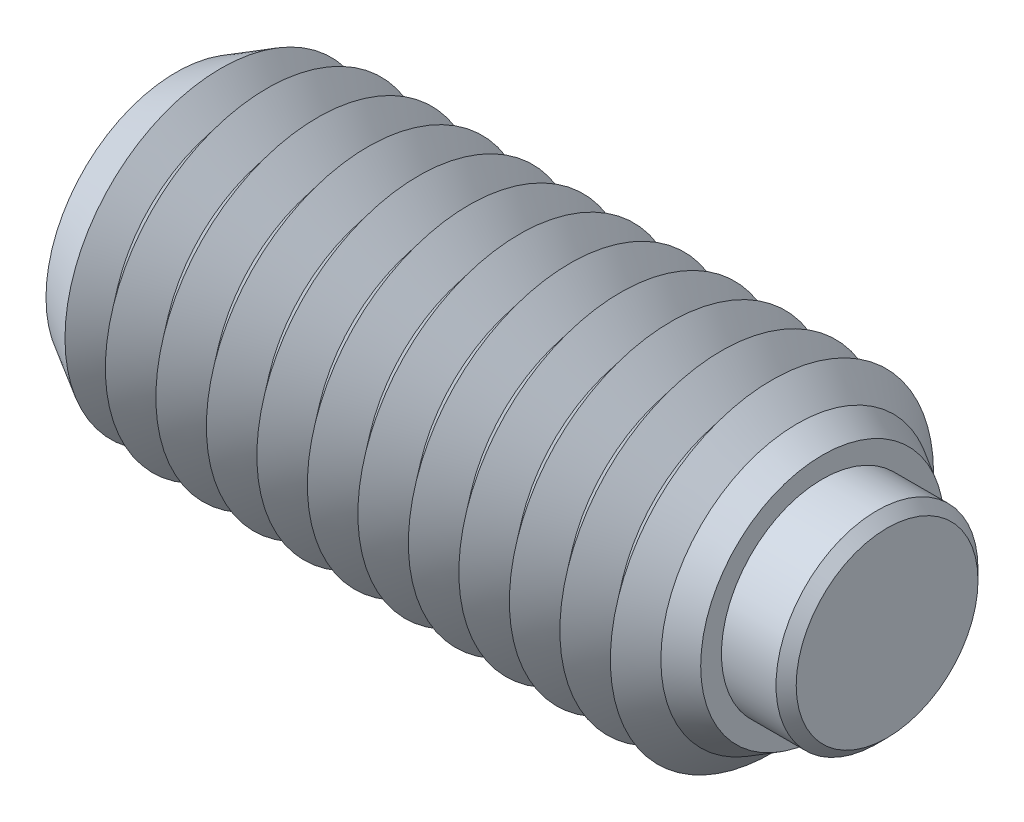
ISO-10303-21;
HEADER;
FILE_DESCRIPTION(('STEP AP214'),'2;1');
FILE_NAME('part.step','',(''),(''),'','','');
FILE_SCHEMA(('AUTOMOTIVE_DESIGN { 1 0 10303 214 1 1 1 1 }'));
ENDSEC;
DATA;
#1=APPLICATION_CONTEXT('core data for automotive mechanical design processes');
#2=APPLICATION_PROTOCOL_DEFINITION('international standard','automotive_design',2000,#1);
#3=PRODUCT_CONTEXT('',#1,'mechanical');
#4=PRODUCT('Part','Part','',(#3));
#5=PRODUCT_RELATED_PRODUCT_CATEGORY('part','',(#4));
#6=PRODUCT_DEFINITION_FORMATION('','',#4);
#7=PRODUCT_DEFINITION_CONTEXT('part definition',#1,'design');
#8=PRODUCT_DEFINITION('design','',#6,#7);
#9=PRODUCT_DEFINITION_SHAPE('','',#8);
#10=(LENGTH_UNIT() NAMED_UNIT(*) SI_UNIT(.MILLI.,.METRE.));
#11=(NAMED_UNIT(*) PLANE_ANGLE_UNIT() SI_UNIT($,.RADIAN.));
#12=(NAMED_UNIT(*) SI_UNIT($,.STERADIAN.) SOLID_ANGLE_UNIT());
#13=UNCERTAINTY_MEASURE_WITH_UNIT(LENGTH_MEASURE(1.E-05),#10,'distance_accuracy_value','');
#14=(GEOMETRIC_REPRESENTATION_CONTEXT(3) GLOBAL_UNCERTAINTY_ASSIGNED_CONTEXT((#13)) GLOBAL_UNIT_ASSIGNED_CONTEXT((#10,
#11,#12)) REPRESENTATION_CONTEXT('',''));
#15=CARTESIAN_POINT('',(0.,0.,0.));
#16=DIRECTION('',(0.,0.,1.));
#17=DIRECTION('',(1.,0.,0.));
#18=AXIS2_PLACEMENT_3D('',#15,#16,#17);
#19=CARTESIAN_POINT('',(2.225,0.,0.));
#20=DIRECTION('',(-1.,0.,0.));
#21=DIRECTION('',(0.,0.,1.));
#22=AXIS2_PLACEMENT_3D('',#19,#20,#21);
#23=CYLINDRICAL_SURFACE('',#22,2.5);
#24=CARTESIAN_POINT('',(1.975,0.,0.));
#25=DIRECTION('',(1.,0.,0.));
#26=DIRECTION('',(0.,0.,-1.));
#27=AXIS2_PLACEMENT_3D('',#24,#25,#26);
#28=CIRCLE('',#27,2.5);
#29=CARTESIAN_POINT('',(1.975,0.,-2.5));
#30=VERTEX_POINT('',#29);
#31=EDGE_CURVE('P0_E10',#30,#30,#28,.F.);
#32=ORIENTED_EDGE('',*,*,#31,.T.);
#33=EDGE_LOOP('',(#32));
#34=FACE_BOUND('',#33,.T.);
#35=CARTESIAN_POINT('',(-0.975,0.,0.));
#36=DIRECTION('',(1.,0.,0.));
#37=DIRECTION('',(0.,0.,-1.));
#38=AXIS2_PLACEMENT_3D('',#35,#36,#37);
#39=CIRCLE('',#38,2.5);
#40=CARTESIAN_POINT('',(-0.975,0.,-2.5));
#41=VERTEX_POINT('',#40);
#42=EDGE_CURVE('P0_E25',#41,#41,#39,.T.);
#43=ORIENTED_EDGE('',*,*,#42,.T.);
#44=EDGE_LOOP('',(#43));
#45=FACE_BOUND('',#44,.T.);
#46=ADVANCED_FACE('P0_F14',(#34,#45),#23,.T.);
#47=CARTESIAN_POINT('',(2.225,0.,0.));
#48=DIRECTION('',(1.,0.,0.));
#49=DIRECTION('',(0.,0.,-1.));
#50=AXIS2_PLACEMENT_3D('',#47,#48,#49);
#51=PLANE('',#50);
#52=CARTESIAN_POINT('',(2.225,0.,0.));
#53=DIRECTION('',(1.,0.,0.));
#54=DIRECTION('',(0.,0.,-1.));
#55=AXIS2_PLACEMENT_3D('',#52,#53,#54);
#56=CIRCLE('',#55,2.25);
#57=CARTESIAN_POINT('',(2.225,0.,-2.25));
#58=VERTEX_POINT('',#57);
#59=EDGE_CURVE('P0_E21',#58,#58,#56,.T.);
#60=ORIENTED_EDGE('',*,*,#59,.T.);
#61=EDGE_LOOP('',(#60));
#62=FACE_BOUND('',#61,.T.);
#63=ADVANCED_FACE('P0_F35',(#62),#51,.T.);
#64=CARTESIAN_POINT('',(-0.975,0.,0.));
#65=DIRECTION('',(1.,0.,0.));
#66=DIRECTION('',(0.,0.,-1.));
#67=AXIS2_PLACEMENT_3D('',#64,#65,#66);
#68=PLANE('',#67);
#69=ORIENTED_EDGE('',*,*,#42,.F.);
#70=EDGE_LOOP('',(#69));
#71=FACE_BOUND('',#70,.T.);
#72=ADVANCED_FACE('P0_F33',(#71),#68,.F.);
#73=CARTESIAN_POINT('',(2.225,0.,0.));
#74=DIRECTION('',(-1.,0.,0.));
#75=DIRECTION('',(0.,0.,1.));
#76=AXIS2_PLACEMENT_3D('',#73,#74,#75);
#77=CONICAL_SURFACE('',#76,2.25,0.785398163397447);
#78=ORIENTED_EDGE('',*,*,#31,.F.);
#79=EDGE_LOOP('',(#78));
#80=FACE_BOUND('',#79,.T.);
#81=ORIENTED_EDGE('',*,*,#59,.F.);
#82=EDGE_LOOP('',(#81));
#83=FACE_BOUND('',#82,.T.);
#84=ADVANCED_FACE('P0_F16',(#80,#83),#77,.T.);
#85=CLOSED_SHELL('',(#46,#63,#72,#84));
#86=MANIFOLD_SOLID_BREP('P0_B1',#85);
#87=CARTESIAN_POINT('',(-14.375,0.,0.));
#88=DIRECTION('',(-1.,0.,0.));
#89=DIRECTION('',(0.,0.,1.));
#90=AXIS2_PLACEMENT_3D('',#87,#88,#89);
#91=CONICAL_SURFACE('',#90,4.,0.895664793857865);
#92=CARTESIAN_POINT('',(-13.75,0.,0.));
#93=DIRECTION('',(1.,0.,0.));
#94=DIRECTION('',(0.,0.,-1.));
#95=AXIS2_PLACEMENT_3D('',#92,#93,#94);
#96=CIRCLE('',#95,3.2193752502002);
#97=CARTESIAN_POINT('',(-13.75,0.,-3.2193752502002));
#98=VERTEX_POINT('',#97);
#99=EDGE_CURVE('P1_E775',#98,#98,#96,.T.);
#100=ORIENTED_EDGE('',*,*,#99,.F.);
#101=EDGE_LOOP('',(#100));
#102=FACE_BOUND('',#101,.T.);
#103=CARTESIAN_POINT('',(-14.2636990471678,0.,0.));
#104=DIRECTION('',(1.,0.,0.));
#105=DIRECTION('',(0.,0.,-1.));
#106=AXIS2_PLACEMENT_3D('',#103,#104,#105);
#107=CIRCLE('',#106,3.86098515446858);
#108=CARTESIAN_POINT('',(-14.2636990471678,0.,-3.86098515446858));
#109=VERTEX_POINT('',#108);
#110=EDGE_CURVE('P1_E778',#109,#109,#107,.F.);
#111=ORIENTED_EDGE('',*,*,#110,.F.);
#112=EDGE_LOOP('',(#111));
#113=FACE_BOUND('',#112,.T.);
#114=ADVANCED_FACE('P1_F15',(#102,#113),#91,.T.);
#115=CARTESIAN_POINT('',(-1.25,0.,0.));
#116=DIRECTION('',(1.,0.,0.));
#117=DIRECTION('',(0.,0.,-1.));
#118=AXIS2_PLACEMENT_3D('',#115,#116,#117);
#119=CONICAL_SURFACE('',#118,3.2193752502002,0.895664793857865);
#120=CARTESIAN_POINT('',(-0.625000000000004,0.,0.));
#121=DIRECTION('',(1.,0.,0.));
#122=DIRECTION('',(0.,0.,-1.));
#123=AXIS2_PLACEMENT_3D('',#120,#121,#122);
#124=CIRCLE('',#123,4.);
#125=CARTESIAN_POINT('',(-0.625000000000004,0.,-4.));
#126=VERTEX_POINT('',#125);
#127=EDGE_CURVE('P1_E711',#126,#126,#124,.T.);
#128=ORIENTED_EDGE('',*,*,#127,.F.);
#129=EDGE_LOOP('',(#128));
#130=FACE_BOUND('',#129,.T.);
#131=CARTESIAN_POINT('',(-1.25,0.,0.));
#132=DIRECTION('',(1.,0.,0.));
#133=DIRECTION('',(0.,0.,-1.));
#134=AXIS2_PLACEMENT_3D('',#131,#132,#133);
#135=CIRCLE('',#134,3.2193752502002);
#136=CARTESIAN_POINT('',(-1.25,0.,-3.2193752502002));
#137=VERTEX_POINT('',#136);
#138=EDGE_CURVE('P1_E712',#137,#137,#135,.T.);
#139=ORIENTED_EDGE('',*,*,#138,.T.);
#140=EDGE_LOOP('',(#139));
#141=FACE_BOUND('',#140,.T.);
#142=ADVANCED_FACE('P1_F222',(#130,#141),#119,.T.);
#143=CARTESIAN_POINT('',(-1.875,0.,0.));
#144=DIRECTION('',(-1.,0.,0.));
#145=DIRECTION('',(0.,0.,1.));
#146=AXIS2_PLACEMENT_3D('',#143,#144,#145);
#147=CONICAL_SURFACE('',#146,4.,0.895664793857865);
#148=ORIENTED_EDGE('',*,*,#138,.F.);
#149=EDGE_LOOP('',(#148));
#150=FACE_BOUND('',#149,.T.);
#151=CARTESIAN_POINT('',(-1.875,0.,0.));
#152=DIRECTION('',(1.,0.,0.));
#153=DIRECTION('',(0.,0.,-1.));
#154=AXIS2_PLACEMENT_3D('',#151,#152,#153);
#155=CIRCLE('',#154,4.);
#156=CARTESIAN_POINT('',(-1.875,0.,-4.));
#157=VERTEX_POINT('',#156);
#158=EDGE_CURVE('P1_E716',#157,#157,#155,.T.);
#159=ORIENTED_EDGE('',*,*,#158,.T.);
#160=EDGE_LOOP('',(#159));
#161=FACE_BOUND('',#160,.T.);
#162=ADVANCED_FACE('P1_F227',(#150,#161),#147,.T.);
#163=CARTESIAN_POINT('',(-0.975,0.,0.));
#164=DIRECTION('',(1.,0.,0.));
#165=DIRECTION('',(0.,1.,0.));
#166=AXIS2_PLACEMENT_3D('',#163,#164,#165);
#167=PLANE('',#166);
#168=CARTESIAN_POINT('',(-0.975,0.,0.));
#169=DIRECTION('',(1.,0.,0.));
#170=DIRECTION('',(0.,1.,0.));
#171=AXIS2_PLACEMENT_3D('',#168,#169,#170);
#172=CIRCLE('',#171,2.5);
#173=CARTESIAN_POINT('',(-0.975,2.5,0.));
#174=VERTEX_POINT('',#173);
#175=EDGE_CURVE('P1_E382',#174,#174,#172,.T.);
#176=ORIENTED_EDGE('',*,*,#175,.T.);
#177=EDGE_LOOP('',(#176));
#178=FACE_BOUND('',#177,.T.);
#179=ADVANCED_FACE('P1_F309',(#178),#167,.T.);
#180=CARTESIAN_POINT('',(-0.975,0.,0.));
#181=DIRECTION('',(1.,0.,0.));
#182=DIRECTION('',(0.,1.,0.));
#183=AXIS2_PLACEMENT_3D('',#180,#181,#182);
#184=CYLINDRICAL_SURFACE('',#183,2.5);
#185=ORIENTED_EDGE('',*,*,#175,.F.);
#186=EDGE_LOOP('',(#185));
#187=FACE_BOUND('',#186,.T.);
#188=CARTESIAN_POINT('',(0.625,0.,0.));
#189=DIRECTION('',(1.,0.,0.));
#190=DIRECTION('',(0.,1.,0.));
#191=AXIS2_PLACEMENT_3D('',#188,#189,#190);
#192=CIRCLE('',#191,2.5);
#193=CARTESIAN_POINT('',(0.625,2.5,0.));
#194=VERTEX_POINT('',#193);
#195=EDGE_CURVE('P1_E385',#194,#194,#192,.T.);
#196=ORIENTED_EDGE('',*,*,#195,.T.);
#197=EDGE_LOOP('',(#196));
#198=FACE_BOUND('',#197,.T.);
#199=ADVANCED_FACE('P1_F209',(#187,#198),#184,.F.);
#200=CARTESIAN_POINT('',(0.625,3.01415608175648,0.));
#201=DIRECTION('',(1.,0.,0.));
#202=DIRECTION('',(0.,1.,0.));
#203=AXIS2_PLACEMENT_3D('',#200,#201,#202);
#204=PLANE('',#203);
#205=ORIENTED_EDGE('',*,*,#195,.F.);
#206=EDGE_LOOP('',(#205));
#207=FACE_BOUND('',#206,.T.);
#208=CARTESIAN_POINT('',(0.625,0.,0.));
#209=DIRECTION('',(1.,0.,0.));
#210=DIRECTION('',(0.,1.,0.));
#211=AXIS2_PLACEMENT_3D('',#208,#209,#210);
#212=CIRCLE('',#211,3.01415608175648);
#213=CARTESIAN_POINT('',(0.625,3.01415608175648,0.));
#214=VERTEX_POINT('',#213);
#215=EDGE_CURVE('P1_E121',#214,#214,#212,.T.);
#216=ORIENTED_EDGE('',*,*,#215,.T.);
#217=EDGE_LOOP('',(#216));
#218=FACE_BOUND('',#217,.T.);
#219=ADVANCED_FACE('P1_F206',(#207,#218),#204,.T.);
#220=CARTESIAN_POINT('',(0.625,0.,0.));
#221=DIRECTION('',(-1.,0.,0.));
#222=DIRECTION('',(0.,-1.,0.));
#223=AXIS2_PLACEMENT_3D('',#220,#221,#222);
#224=CONICAL_SURFACE('',#223,3.01415608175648,0.523598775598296);
#225=CARTESIAN_POINT('',(0.,0.,0.));
#226=DIRECTION('',(1.,0.,0.));
#227=DIRECTION('',(0.,0.,-1.));
#228=AXIS2_PLACEMENT_3D('',#225,#226,#227);
#229=CIRCLE('',#228,3.375);
#230=CARTESIAN_POINT('',(0.,0.,-3.375));
#231=VERTEX_POINT('',#230);
#232=EDGE_CURVE('P1_E373',#231,#231,#229,.T.);
#233=ORIENTED_EDGE('',*,*,#232,.T.);
#234=EDGE_LOOP('',(#233));
#235=FACE_BOUND('',#234,.T.);
#236=ORIENTED_EDGE('',*,*,#215,.F.);
#237=EDGE_LOOP('',(#236));
#238=FACE_BOUND('',#237,.T.);
#239=ADVANCED_FACE('P1_F203',(#235,#238),#224,.T.);
#240=CARTESIAN_POINT('',(0.,0.,0.));
#241=DIRECTION('',(-1.,0.,0.));
#242=DIRECTION('',(0.,0.,1.));
#243=AXIS2_PLACEMENT_3D('',#240,#241,#242);
#244=CONICAL_SURFACE('',#243,3.375,0.785398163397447);
#245=ORIENTED_EDGE('',*,*,#127,.T.);
#246=EDGE_LOOP('',(#245));
#247=FACE_BOUND('',#246,.T.);
#248=ORIENTED_EDGE('',*,*,#232,.F.);
#249=EDGE_LOOP('',(#248));
#250=FACE_BOUND('',#249,.T.);
#251=ADVANCED_FACE('P1_F17',(#247,#250),#244,.T.);
#252=CARTESIAN_POINT('',(-2.5,0.,0.));
#253=DIRECTION('',(1.,0.,0.));
#254=DIRECTION('',(0.,0.,-1.));
#255=AXIS2_PLACEMENT_3D('',#252,#253,#254);
#256=CONICAL_SURFACE('',#255,3.2193752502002,0.895664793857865);
#257=ORIENTED_EDGE('',*,*,#158,.F.);
#258=EDGE_LOOP('',(#257));
#259=FACE_BOUND('',#258,.T.);
#260=CARTESIAN_POINT('',(-2.5,0.,0.));
#261=DIRECTION('',(1.,0.,0.));
#262=DIRECTION('',(0.,0.,-1.));
#263=AXIS2_PLACEMENT_3D('',#260,#261,#262);
#264=CIRCLE('',#263,3.2193752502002);
#265=CARTESIAN_POINT('',(-2.5,0.,-3.2193752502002));
#266=VERTEX_POINT('',#265);
#267=EDGE_CURVE('P1_E721',#266,#266,#264,.T.);
#268=ORIENTED_EDGE('',*,*,#267,.T.);
#269=EDGE_LOOP('',(#268));
#270=FACE_BOUND('',#269,.T.);
#271=ADVANCED_FACE('P1_F303',(#259,#270),#256,.T.);
#272=CARTESIAN_POINT('',(-3.125,0.,0.));
#273=DIRECTION('',(-1.,0.,0.));
#274=DIRECTION('',(0.,0.,1.));
#275=AXIS2_PLACEMENT_3D('',#272,#273,#274);
#276=CONICAL_SURFACE('',#275,4.,0.895664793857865);
#277=ORIENTED_EDGE('',*,*,#267,.F.);
#278=EDGE_LOOP('',(#277));
#279=FACE_BOUND('',#278,.T.);
#280=CARTESIAN_POINT('',(-3.125,0.,0.));
#281=DIRECTION('',(1.,0.,0.));
#282=DIRECTION('',(0.,0.,-1.));
#283=AXIS2_PLACEMENT_3D('',#280,#281,#282);
#284=CIRCLE('',#283,4.);
#285=CARTESIAN_POINT('',(-3.125,0.,-4.));
#286=VERTEX_POINT('',#285);
#287=EDGE_CURVE('P1_E724',#286,#286,#284,.T.);
#288=ORIENTED_EDGE('',*,*,#287,.T.);
#289=EDGE_LOOP('',(#288));
#290=FACE_BOUND('',#289,.T.);
#291=ADVANCED_FACE('P1_F299',(#279,#290),#276,.T.);
#292=CARTESIAN_POINT('',(-3.75,0.,0.));
#293=DIRECTION('',(1.,0.,0.));
#294=DIRECTION('',(0.,0.,-1.));
#295=AXIS2_PLACEMENT_3D('',#292,#293,#294);
#296=CONICAL_SURFACE('',#295,3.2193752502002,0.895664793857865);
#297=ORIENTED_EDGE('',*,*,#287,.F.);
#298=EDGE_LOOP('',(#297));
#299=FACE_BOUND('',#298,.T.);
#300=CARTESIAN_POINT('',(-3.75,0.,0.));
#301=DIRECTION('',(1.,0.,0.));
#302=DIRECTION('',(0.,0.,-1.));
#303=AXIS2_PLACEMENT_3D('',#300,#301,#302);
#304=CIRCLE('',#303,3.2193752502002);
#305=CARTESIAN_POINT('',(-3.75,0.,-3.2193752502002));
#306=VERTEX_POINT('',#305);
#307=EDGE_CURVE('P1_E727',#306,#306,#304,.T.);
#308=ORIENTED_EDGE('',*,*,#307,.T.);
#309=EDGE_LOOP('',(#308));
#310=FACE_BOUND('',#309,.T.);
#311=ADVANCED_FACE('P1_F295',(#299,#310),#296,.T.);
#312=CARTESIAN_POINT('',(-4.375,0.,0.));
#313=DIRECTION('',(-1.,0.,0.));
#314=DIRECTION('',(0.,0.,1.));
#315=AXIS2_PLACEMENT_3D('',#312,#313,#314);
#316=CONICAL_SURFACE('',#315,4.,0.895664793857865);
#317=ORIENTED_EDGE('',*,*,#307,.F.);
#318=EDGE_LOOP('',(#317));
#319=FACE_BOUND('',#318,.T.);
#320=CARTESIAN_POINT('',(-4.375,0.,0.));
#321=DIRECTION('',(1.,0.,0.));
#322=DIRECTION('',(0.,0.,-1.));
#323=AXIS2_PLACEMENT_3D('',#320,#321,#322);
#324=CIRCLE('',#323,4.);
#325=CARTESIAN_POINT('',(-4.375,0.,-4.));
#326=VERTEX_POINT('',#325);
#327=EDGE_CURVE('P1_E730',#326,#326,#324,.T.);
#328=ORIENTED_EDGE('',*,*,#327,.T.);
#329=EDGE_LOOP('',(#328));
#330=FACE_BOUND('',#329,.T.);
#331=ADVANCED_FACE('P1_F291',(#319,#330),#316,.T.);
#332=CARTESIAN_POINT('',(-5.,0.,0.));
#333=DIRECTION('',(1.,0.,0.));
#334=DIRECTION('',(0.,0.,-1.));
#335=AXIS2_PLACEMENT_3D('',#332,#333,#334);
#336=CONICAL_SURFACE('',#335,3.2193752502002,0.895664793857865);
#337=ORIENTED_EDGE('',*,*,#327,.F.);
#338=EDGE_LOOP('',(#337));
#339=FACE_BOUND('',#338,.T.);
#340=CARTESIAN_POINT('',(-5.,0.,0.));
#341=DIRECTION('',(1.,0.,0.));
#342=DIRECTION('',(0.,0.,-1.));
#343=AXIS2_PLACEMENT_3D('',#340,#341,#342);
#344=CIRCLE('',#343,3.2193752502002);
#345=CARTESIAN_POINT('',(-5.,0.,-3.2193752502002));
#346=VERTEX_POINT('',#345);
#347=EDGE_CURVE('P1_E733',#346,#346,#344,.T.);
#348=ORIENTED_EDGE('',*,*,#347,.T.);
#349=EDGE_LOOP('',(#348));
#350=FACE_BOUND('',#349,.T.);
#351=ADVANCED_FACE('P1_F287',(#339,#350),#336,.T.);
#352=CARTESIAN_POINT('',(-5.625,0.,0.));
#353=DIRECTION('',(-1.,0.,0.));
#354=DIRECTION('',(0.,0.,1.));
#355=AXIS2_PLACEMENT_3D('',#352,#353,#354);
#356=CONICAL_SURFACE('',#355,4.,0.895664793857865);
#357=ORIENTED_EDGE('',*,*,#347,.F.);
#358=EDGE_LOOP('',(#357));
#359=FACE_BOUND('',#358,.T.);
#360=CARTESIAN_POINT('',(-5.625,0.,0.));
#361=DIRECTION('',(1.,0.,0.));
#362=DIRECTION('',(0.,0.,-1.));
#363=AXIS2_PLACEMENT_3D('',#360,#361,#362);
#364=CIRCLE('',#363,4.);
#365=CARTESIAN_POINT('',(-5.625,0.,-4.));
#366=VERTEX_POINT('',#365);
#367=EDGE_CURVE('P1_E736',#366,#366,#364,.T.);
#368=ORIENTED_EDGE('',*,*,#367,.T.);
#369=EDGE_LOOP('',(#368));
#370=FACE_BOUND('',#369,.T.);
#371=ADVANCED_FACE('P1_F283',(#359,#370),#356,.T.);
#372=CARTESIAN_POINT('',(-6.25,0.,0.));
#373=DIRECTION('',(1.,0.,0.));
#374=DIRECTION('',(0.,0.,-1.));
#375=AXIS2_PLACEMENT_3D('',#372,#373,#374);
#376=CONICAL_SURFACE('',#375,3.2193752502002,0.895664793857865);
#377=ORIENTED_EDGE('',*,*,#367,.F.);
#378=EDGE_LOOP('',(#377));
#379=FACE_BOUND('',#378,.T.);
#380=CARTESIAN_POINT('',(-6.25,0.,0.));
#381=DIRECTION('',(1.,0.,0.));
#382=DIRECTION('',(0.,0.,-1.));
#383=AXIS2_PLACEMENT_3D('',#380,#381,#382);
#384=CIRCLE('',#383,3.2193752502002);
#385=CARTESIAN_POINT('',(-6.25,0.,-3.2193752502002));
#386=VERTEX_POINT('',#385);
#387=EDGE_CURVE('P1_E739',#386,#386,#384,.T.);
#388=ORIENTED_EDGE('',*,*,#387,.T.);
#389=EDGE_LOOP('',(#388));
#390=FACE_BOUND('',#389,.T.);
#391=ADVANCED_FACE('P1_F279',(#379,#390),#376,.T.);
#392=CARTESIAN_POINT('',(-6.875,0.,0.));
#393=DIRECTION('',(-1.,0.,0.));
#394=DIRECTION('',(0.,0.,1.));
#395=AXIS2_PLACEMENT_3D('',#392,#393,#394);
#396=CONICAL_SURFACE('',#395,4.,0.895664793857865);
#397=ORIENTED_EDGE('',*,*,#387,.F.);
#398=EDGE_LOOP('',(#397));
#399=FACE_BOUND('',#398,.T.);
#400=CARTESIAN_POINT('',(-6.875,0.,0.));
#401=DIRECTION('',(1.,0.,0.));
#402=DIRECTION('',(0.,0.,-1.));
#403=AXIS2_PLACEMENT_3D('',#400,#401,#402);
#404=CIRCLE('',#403,4.);
#405=CARTESIAN_POINT('',(-6.875,0.,-4.));
#406=VERTEX_POINT('',#405);
#407=EDGE_CURVE('P1_E742',#406,#406,#404,.T.);
#408=ORIENTED_EDGE('',*,*,#407,.T.);
#409=EDGE_LOOP('',(#408));
#410=FACE_BOUND('',#409,.T.);
#411=ADVANCED_FACE('P1_F275',(#399,#410),#396,.T.);
#412=CARTESIAN_POINT('',(-7.50000000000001,0.,0.));
#413=DIRECTION('',(1.,0.,0.));
#414=DIRECTION('',(0.,0.,-1.));
#415=AXIS2_PLACEMENT_3D('',#412,#413,#414);
#416=CONICAL_SURFACE('',#415,3.2193752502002,0.895664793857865);
#417=ORIENTED_EDGE('',*,*,#407,.F.);
#418=EDGE_LOOP('',(#417));
#419=FACE_BOUND('',#418,.T.);
#420=CARTESIAN_POINT('',(-7.50000000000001,0.,0.));
#421=DIRECTION('',(1.,0.,0.));
#422=DIRECTION('',(0.,0.,-1.));
#423=AXIS2_PLACEMENT_3D('',#420,#421,#422);
#424=CIRCLE('',#423,3.2193752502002);
#425=CARTESIAN_POINT('',(-7.50000000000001,0.,-3.2193752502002));
#426=VERTEX_POINT('',#425);
#427=EDGE_CURVE('P1_E745',#426,#426,#424,.T.);
#428=ORIENTED_EDGE('',*,*,#427,.T.);
#429=EDGE_LOOP('',(#428));
#430=FACE_BOUND('',#429,.T.);
#431=ADVANCED_FACE('P1_F271',(#419,#430),#416,.T.);
#432=CARTESIAN_POINT('',(-8.125,0.,0.));
#433=DIRECTION('',(-1.,0.,0.));
#434=DIRECTION('',(0.,0.,1.));
#435=AXIS2_PLACEMENT_3D('',#432,#433,#434);
#436=CONICAL_SURFACE('',#435,4.,0.895664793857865);
#437=ORIENTED_EDGE('',*,*,#427,.F.);
#438=EDGE_LOOP('',(#437));
#439=FACE_BOUND('',#438,.T.);
#440=CARTESIAN_POINT('',(-8.125,0.,0.));
#441=DIRECTION('',(1.,0.,0.));
#442=DIRECTION('',(0.,0.,-1.));
#443=AXIS2_PLACEMENT_3D('',#440,#441,#442);
#444=CIRCLE('',#443,4.);
#445=CARTESIAN_POINT('',(-8.125,0.,-4.));
#446=VERTEX_POINT('',#445);
#447=EDGE_CURVE('P1_E748',#446,#446,#444,.T.);
#448=ORIENTED_EDGE('',*,*,#447,.T.);
#449=EDGE_LOOP('',(#448));
#450=FACE_BOUND('',#449,.T.);
#451=ADVANCED_FACE('P1_F267',(#439,#450),#436,.T.);
#452=CARTESIAN_POINT('',(-8.75,0.,0.));
#453=DIRECTION('',(1.,0.,0.));
#454=DIRECTION('',(0.,0.,-1.));
#455=AXIS2_PLACEMENT_3D('',#452,#453,#454);
#456=CONICAL_SURFACE('',#455,3.2193752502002,0.895664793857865);
#457=ORIENTED_EDGE('',*,*,#447,.F.);
#458=EDGE_LOOP('',(#457));
#459=FACE_BOUND('',#458,.T.);
#460=CARTESIAN_POINT('',(-8.75,0.,0.));
#461=DIRECTION('',(1.,0.,0.));
#462=DIRECTION('',(0.,0.,-1.));
#463=AXIS2_PLACEMENT_3D('',#460,#461,#462);
#464=CIRCLE('',#463,3.2193752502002);
#465=CARTESIAN_POINT('',(-8.75,0.,-3.2193752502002));
#466=VERTEX_POINT('',#465);
#467=EDGE_CURVE('P1_E751',#466,#466,#464,.T.);
#468=ORIENTED_EDGE('',*,*,#467,.T.);
#469=EDGE_LOOP('',(#468));
#470=FACE_BOUND('',#469,.T.);
#471=ADVANCED_FACE('P1_F263',(#459,#470),#456,.T.);
#472=CARTESIAN_POINT('',(-9.375,0.,0.));
#473=DIRECTION('',(-1.,0.,0.));
#474=DIRECTION('',(0.,0.,1.));
#475=AXIS2_PLACEMENT_3D('',#472,#473,#474);
#476=CONICAL_SURFACE('',#475,4.,0.895664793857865);
#477=ORIENTED_EDGE('',*,*,#467,.F.);
#478=EDGE_LOOP('',(#477));
#479=FACE_BOUND('',#478,.T.);
#480=CARTESIAN_POINT('',(-9.37500000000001,0.,0.));
#481=DIRECTION('',(1.,0.,0.));
#482=DIRECTION('',(0.,0.,-1.));
#483=AXIS2_PLACEMENT_3D('',#480,#481,#482);
#484=CIRCLE('',#483,4.);
#485=CARTESIAN_POINT('',(-9.37500000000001,0.,-4.));
#486=VERTEX_POINT('',#485);
#487=EDGE_CURVE('P1_E754',#486,#486,#484,.T.);
#488=ORIENTED_EDGE('',*,*,#487,.T.);
#489=EDGE_LOOP('',(#488));
#490=FACE_BOUND('',#489,.T.);
#491=ADVANCED_FACE('P1_F259',(#479,#490),#476,.T.);
#492=CARTESIAN_POINT('',(-10.,0.,0.));
#493=DIRECTION('',(1.,0.,0.));
#494=DIRECTION('',(0.,0.,-1.));
#495=AXIS2_PLACEMENT_3D('',#492,#493,#494);
#496=CONICAL_SURFACE('',#495,3.2193752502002,0.895664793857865);
#497=ORIENTED_EDGE('',*,*,#487,.F.);
#498=EDGE_LOOP('',(#497));
#499=FACE_BOUND('',#498,.T.);
#500=CARTESIAN_POINT('',(-10.,0.,0.));
#501=DIRECTION('',(1.,0.,0.));
#502=DIRECTION('',(0.,0.,-1.));
#503=AXIS2_PLACEMENT_3D('',#500,#501,#502);
#504=CIRCLE('',#503,3.2193752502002);
#505=CARTESIAN_POINT('',(-10.,0.,-3.2193752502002));
#506=VERTEX_POINT('',#505);
#507=EDGE_CURVE('P1_E757',#506,#506,#504,.T.);
#508=ORIENTED_EDGE('',*,*,#507,.T.);
#509=EDGE_LOOP('',(#508));
#510=FACE_BOUND('',#509,.T.);
#511=ADVANCED_FACE('P1_F255',(#499,#510),#496,.T.);
#512=CARTESIAN_POINT('',(-10.625,0.,0.));
#513=DIRECTION('',(-1.,0.,0.));
#514=DIRECTION('',(0.,0.,1.));
#515=AXIS2_PLACEMENT_3D('',#512,#513,#514);
#516=CONICAL_SURFACE('',#515,4.,0.895664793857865);
#517=ORIENTED_EDGE('',*,*,#507,.F.);
#518=EDGE_LOOP('',(#517));
#519=FACE_BOUND('',#518,.T.);
#520=CARTESIAN_POINT('',(-10.625,0.,0.));
#521=DIRECTION('',(1.,0.,0.));
#522=DIRECTION('',(0.,0.,-1.));
#523=AXIS2_PLACEMENT_3D('',#520,#521,#522);
#524=CIRCLE('',#523,4.);
#525=CARTESIAN_POINT('',(-10.625,0.,-4.));
#526=VERTEX_POINT('',#525);
#527=EDGE_CURVE('P1_E760',#526,#526,#524,.T.);
#528=ORIENTED_EDGE('',*,*,#527,.T.);
#529=EDGE_LOOP('',(#528));
#530=FACE_BOUND('',#529,.T.);
#531=ADVANCED_FACE('P1_F251',(#519,#530),#516,.T.);
#532=CARTESIAN_POINT('',(-11.25,0.,0.));
#533=DIRECTION('',(1.,0.,0.));
#534=DIRECTION('',(0.,0.,-1.));
#535=AXIS2_PLACEMENT_3D('',#532,#533,#534);
#536=CONICAL_SURFACE('',#535,3.2193752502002,0.895664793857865);
#537=ORIENTED_EDGE('',*,*,#527,.F.);
#538=EDGE_LOOP('',(#537));
#539=FACE_BOUND('',#538,.T.);
#540=CARTESIAN_POINT('',(-11.25,0.,0.));
#541=DIRECTION('',(1.,0.,0.));
#542=DIRECTION('',(0.,0.,-1.));
#543=AXIS2_PLACEMENT_3D('',#540,#541,#542);
#544=CIRCLE('',#543,3.2193752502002);
#545=CARTESIAN_POINT('',(-11.25,0.,-3.2193752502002));
#546=VERTEX_POINT('',#545);
#547=EDGE_CURVE('P1_E763',#546,#546,#544,.T.);
#548=ORIENTED_EDGE('',*,*,#547,.T.);
#549=EDGE_LOOP('',(#548));
#550=FACE_BOUND('',#549,.T.);
#551=ADVANCED_FACE('P1_F247',(#539,#550),#536,.T.);
#552=CARTESIAN_POINT('',(-11.875,0.,0.));
#553=DIRECTION('',(-1.,0.,0.));
#554=DIRECTION('',(0.,0.,1.));
#555=AXIS2_PLACEMENT_3D('',#552,#553,#554);
#556=CONICAL_SURFACE('',#555,4.,0.895664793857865);
#557=ORIENTED_EDGE('',*,*,#547,.F.);
#558=EDGE_LOOP('',(#557));
#559=FACE_BOUND('',#558,.T.);
#560=CARTESIAN_POINT('',(-11.875,0.,0.));
#561=DIRECTION('',(1.,0.,0.));
#562=DIRECTION('',(0.,0.,-1.));
#563=AXIS2_PLACEMENT_3D('',#560,#561,#562);
#564=CIRCLE('',#563,4.);
#565=CARTESIAN_POINT('',(-11.875,0.,-4.));
#566=VERTEX_POINT('',#565);
#567=EDGE_CURVE('P1_E766',#566,#566,#564,.T.);
#568=ORIENTED_EDGE('',*,*,#567,.T.);
#569=EDGE_LOOP('',(#568));
#570=FACE_BOUND('',#569,.T.);
#571=ADVANCED_FACE('P1_F243',(#559,#570),#556,.T.);
#572=CARTESIAN_POINT('',(-12.5,0.,0.));
#573=DIRECTION('',(1.,0.,0.));
#574=DIRECTION('',(0.,0.,-1.));
#575=AXIS2_PLACEMENT_3D('',#572,#573,#574);
#576=CONICAL_SURFACE('',#575,3.2193752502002,0.895664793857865);
#577=ORIENTED_EDGE('',*,*,#567,.F.);
#578=EDGE_LOOP('',(#577));
#579=FACE_BOUND('',#578,.T.);
#580=CARTESIAN_POINT('',(-12.5,0.,0.));
#581=DIRECTION('',(1.,0.,0.));
#582=DIRECTION('',(0.,0.,-1.));
#583=AXIS2_PLACEMENT_3D('',#580,#581,#582);
#584=CIRCLE('',#583,3.2193752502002);
#585=CARTESIAN_POINT('',(-12.5,0.,-3.2193752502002));
#586=VERTEX_POINT('',#585);
#587=EDGE_CURVE('P1_E769',#586,#586,#584,.T.);
#588=ORIENTED_EDGE('',*,*,#587,.T.);
#589=EDGE_LOOP('',(#588));
#590=FACE_BOUND('',#589,.T.);
#591=ADVANCED_FACE('P1_F239',(#579,#590),#576,.T.);
#592=CARTESIAN_POINT('',(-13.125,0.,0.));
#593=DIRECTION('',(-1.,0.,0.));
#594=DIRECTION('',(0.,0.,1.));
#595=AXIS2_PLACEMENT_3D('',#592,#593,#594);
#596=CONICAL_SURFACE('',#595,4.,0.895664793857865);
#597=ORIENTED_EDGE('',*,*,#587,.F.);
#598=EDGE_LOOP('',(#597));
#599=FACE_BOUND('',#598,.T.);
#600=CARTESIAN_POINT('',(-13.125,0.,0.));
#601=DIRECTION('',(1.,0.,0.));
#602=DIRECTION('',(0.,0.,-1.));
#603=AXIS2_PLACEMENT_3D('',#600,#601,#602);
#604=CIRCLE('',#603,4.);
#605=CARTESIAN_POINT('',(-13.125,0.,-4.));
#606=VERTEX_POINT('',#605);
#607=EDGE_CURVE('P1_E772',#606,#606,#604,.T.);
#608=ORIENTED_EDGE('',*,*,#607,.T.);
#609=EDGE_LOOP('',(#608));
#610=FACE_BOUND('',#609,.T.);
#611=ADVANCED_FACE('P1_F235',(#599,#610),#596,.T.);
#612=CARTESIAN_POINT('',(-13.75,0.,0.));
#613=DIRECTION('',(1.,0.,0.));
#614=DIRECTION('',(0.,0.,-1.));
#615=AXIS2_PLACEMENT_3D('',#612,#613,#614);
#616=CONICAL_SURFACE('',#615,3.2193752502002,0.895664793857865);
#617=ORIENTED_EDGE('',*,*,#607,.F.);
#618=EDGE_LOOP('',(#617));
#619=FACE_BOUND('',#618,.T.);
#620=ORIENTED_EDGE('',*,*,#99,.T.);
#621=EDGE_LOOP('',(#620));
#622=FACE_BOUND('',#621,.T.);
#623=ADVANCED_FACE('P1_F219',(#619,#622),#616,.T.);
#624=CARTESIAN_POINT('',(-15.375,0.,0.));
#625=DIRECTION('',(1.,0.,0.));
#626=DIRECTION('',(0.,0.,1.));
#627=AXIS2_PLACEMENT_3D('',#624,#625,#626);
#628=CONICAL_SURFACE('',#627,3.2193752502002,0.5235987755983);
#629=CARTESIAN_POINT('',(-15.375,0.,0.));
#630=DIRECTION('',(-1.,0.,0.));
#631=DIRECTION('',(0.,0.,1.));
#632=AXIS2_PLACEMENT_3D('',#629,#630,#631);
#633=CIRCLE('',#632,3.2193752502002);
#634=CARTESIAN_POINT('',(-15.375,0.,3.2193752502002));
#635=VERTEX_POINT('',#634);
#636=EDGE_CURVE('P1_E780',#635,#635,#633,.T.);
#637=ORIENTED_EDGE('',*,*,#636,.F.);
#638=EDGE_LOOP('',(#637));
#639=FACE_BOUND('',#638,.T.);
#640=ORIENTED_EDGE('',*,*,#110,.T.);
#641=EDGE_LOOP('',(#640));
#642=FACE_BOUND('',#641,.T.);
#643=ADVANCED_FACE('P1_F159',(#639,#642),#628,.T.);
#644=CARTESIAN_POINT('',(-15.375,0.,0.));
#645=DIRECTION('',(1.,0.,0.));
#646=DIRECTION('',(0.,0.,-1.));
#647=AXIS2_PLACEMENT_3D('',#644,#645,#646);
#648=PLANE('',#647);
#649=CARTESIAN_POINT('',(-15.375,0.,0.));
#650=DIRECTION('',(1.,0.,0.));
#651=DIRECTION('',(0.,0.,-1.));
#652=AXIS2_PLACEMENT_3D('',#649,#650,#651);
#653=CIRCLE('',#652,2.3094010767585);
#654=CARTESIAN_POINT('',(-15.375,-2.,-1.15470053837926));
#655=VERTEX_POINT('',#654);
#656=CARTESIAN_POINT('',(-15.375,0.,-2.3094010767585));
#657=VERTEX_POINT('',#656);
#658=EDGE_CURVE('P1_E19',#655,#657,#653,.T.);
#659=ORIENTED_EDGE('',*,*,#658,.T.);
#660=CARTESIAN_POINT('',(-15.375,2.,-1.15470053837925));
#661=VERTEX_POINT('',#660);
#662=EDGE_CURVE('P1_E10',#657,#661,#653,.T.);
#663=ORIENTED_EDGE('',*,*,#662,.T.);
#664=CARTESIAN_POINT('',(-15.375,2.,1.15470053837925));
#665=VERTEX_POINT('',#664);
#666=EDGE_CURVE('P1_E24',#661,#665,#653,.T.);
#667=ORIENTED_EDGE('',*,*,#666,.T.);
#668=CARTESIAN_POINT('',(-15.375,0.,0.));
#669=DIRECTION('',(-1.,0.,0.));
#670=DIRECTION('',(0.,0.,1.));
#671=AXIS2_PLACEMENT_3D('',#668,#669,#670);
#672=CIRCLE('',#671,2.3094010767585);
#673=CARTESIAN_POINT('',(-15.375,0.,2.3094010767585));
#674=VERTEX_POINT('',#673);
#675=EDGE_CURVE('P1_E92',#674,#665,#672,.T.);
#676=ORIENTED_EDGE('',*,*,#675,.F.);
#677=CARTESIAN_POINT('',(-15.375,-2.,1.15470053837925));
#678=VERTEX_POINT('',#677);
#679=EDGE_CURVE('P1_E101',#674,#678,#653,.T.);
#680=ORIENTED_EDGE('',*,*,#679,.T.);
#681=EDGE_CURVE('P1_E107',#678,#655,#653,.T.);
#682=ORIENTED_EDGE('',*,*,#681,.T.);
#683=EDGE_LOOP('',(#659,#663,#667,#676,#680,#682));
#684=FACE_BOUND('',#683,.T.);
#685=ORIENTED_EDGE('',*,*,#636,.T.);
#686=EDGE_LOOP('',(#685));
#687=FACE_BOUND('',#686,.T.);
#688=ADVANCED_FACE('P1_F108',(#684,#687),#648,.F.);
#689=CARTESIAN_POINT('',(-15.375,0.,0.));
#690=DIRECTION('',(-1.,0.,0.));
#691=DIRECTION('',(0.,0.,1.));
#692=AXIS2_PLACEMENT_3D('',#689,#690,#691);
#693=CONICAL_SURFACE('',#692,2.3094010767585,1.0471975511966);
#694=ORIENTED_EDGE('',*,*,#658,.F.);
#695=CARTESIAN_POINT('',(-15.3750666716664,0.000199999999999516,-2.30951654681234));
#696=CARTESIAN_POINT('',(-15.3457567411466,-0.0876912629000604,-2.25877250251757));
#697=CARTESIAN_POINT('',(-15.3191000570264,-0.176341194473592,-2.20759044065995));
#698=CARTESIAN_POINT('',(-15.2725696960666,-0.355176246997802,-2.10433997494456));
#699=CARTESIAN_POINT('',(-15.2527124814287,-0.445364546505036,-2.0522697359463));
#700=CARTESIAN_POINT('',(-15.2218006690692,-0.624623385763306,-1.94877459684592));
#701=CARTESIAN_POINT('',(-15.2105403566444,-0.713666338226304,-1.89736562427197));
#702=CARTESIAN_POINT('',(-15.1970958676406,-0.892171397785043,-1.79430568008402));
#703=CARTESIAN_POINT('',(-15.1949005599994,-0.981632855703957,-1.74265508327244));
#704=CARTESIAN_POINT('',(-15.1994581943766,-1.1488083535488,-1.64613626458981));
#705=CARTESIAN_POINT('',(-15.2050920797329,-1.22654737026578,-1.60125362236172));
#706=CARTESIAN_POINT('',(-15.2229511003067,-1.38151891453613,-1.51178075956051));
#707=CARTESIAN_POINT('',(-15.2351823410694,-1.4587509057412,-1.46719084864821));
#708=CARTESIAN_POINT('',(-15.2657606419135,-1.6140421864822,-1.37753338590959));
#709=CARTESIAN_POINT('',(-15.2842373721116,-1.69208181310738,-1.33247718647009));
#710=CARTESIAN_POINT('',(-15.3261727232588,-1.84699686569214,-1.24303693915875));
#711=CARTESIAN_POINT('',(-15.3496214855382,-1.92387427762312,-1.1986517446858));
#712=CARTESIAN_POINT('',(-15.3750666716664,-2.0002,-1.15458506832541));
#713=B_SPLINE_CURVE_WITH_KNOTS('',3,(#695,#696,#697,#698,#699,#700,#701,#702,#703,#704,#705,
#706,#707,#708,#709,#710,#711,#712),.UNSPECIFIED.,.F.,.F.,(4,2,2,2,2,2,2,2,4),(0.,
0.317031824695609,0.634825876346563,0.944753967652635,1.25430138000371,1.52387047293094,
1.79368946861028,2.06949491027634,2.34475850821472),.UNSPECIFIED.);
#714=EDGE_CURVE('P1_E130',#657,#655,#713,.T.);
#715=ORIENTED_EDGE('',*,*,#714,.F.);
#716=EDGE_LOOP('',(#694,#715));
#717=FACE_BOUND('',#716,.T.);
#718=ADVANCED_FACE('P1_F158',(#717),#693,.F.);
#719=ORIENTED_EDGE('',*,*,#681,.F.);
#720=CARTESIAN_POINT('',(-16.1186705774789,-2.,-2.99029024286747));
#721=CARTESIAN_POINT('',(-16.0772350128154,-2.,-2.90392335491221));
#722=CARTESIAN_POINT('',(-16.0362298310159,-2.,-2.81734606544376));
#723=CARTESIAN_POINT('',(-15.9553243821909,-2.,-2.64365854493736));
#724=CARTESIAN_POINT('',(-15.9154243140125,-2.,-2.55654822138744));
#725=CARTESIAN_POINT('',(-15.8367503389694,-2.,-2.38118302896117));
#726=CARTESIAN_POINT('',(-15.7979847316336,-2.,-2.29292442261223));
#727=CARTESIAN_POINT('',(-15.7221918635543,-2.,-2.11566660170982));
#728=CARTESIAN_POINT('',(-15.6851645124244,-2.,-2.02666742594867));
#729=CARTESIAN_POINT('',(-15.6123681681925,-2.,-1.84544249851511));
#730=CARTESIAN_POINT('',(-15.576657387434,-2.,-1.75319322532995));
#731=CARTESIAN_POINT('',(-15.5082048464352,-2.,-1.56757885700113));
#732=CARTESIAN_POINT('',(-15.4754634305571,-2.,-1.4742136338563));
#733=CARTESIAN_POINT('',(-15.4138859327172,-2.,-1.28643446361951));
#734=CARTESIAN_POINT('',(-15.3850408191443,-2.,-1.19202351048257));
#735=CARTESIAN_POINT('',(-15.3322423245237,-2.,-1.00184859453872));
#736=CARTESIAN_POINT('',(-15.3082877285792,-2.,-0.906084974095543));
#737=CARTESIAN_POINT('',(-15.2665474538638,-2.,-0.713403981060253));
#738=CARTESIAN_POINT('',(-15.2487491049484,-2.,-0.616489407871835));
#739=CARTESIAN_POINT('',(-15.2204859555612,-2.,-0.421576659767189));
#740=CARTESIAN_POINT('',(-15.2100206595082,-2.,-0.323578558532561));
#741=CARTESIAN_POINT('',(-15.1973976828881,-2.,-0.128212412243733));
#742=CARTESIAN_POINT('',(-15.1951419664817,-2.,-0.0308508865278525));
#743=CARTESIAN_POINT('',(-15.1988660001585,-2.,0.163710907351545));
#744=CARTESIAN_POINT('',(-15.2048462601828,-2.,0.260911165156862));
#745=CARTESIAN_POINT('',(-15.2292367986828,-2.,0.500738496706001));
#746=CARTESIAN_POINT('',(-15.2522179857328,-2.,0.642900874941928));
#747=CARTESIAN_POINT('',(-15.3114797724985,-2.,0.924461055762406));
#748=CARTESIAN_POINT('',(-15.3477764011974,-2.,1.06385531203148));
#749=CARTESIAN_POINT('',(-15.4097799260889,-2.,1.27233476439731));
#750=CARTESIAN_POINT('',(-15.4319967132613,-2.,1.34249760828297));
#751=CARTESIAN_POINT('',(-15.4784854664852,-2.,1.48209294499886));
#752=CARTESIAN_POINT('',(-15.5027561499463,-2.,1.5515258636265));
#753=CARTESIAN_POINT('',(-15.5530002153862,-2.,1.68975413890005));
#754=CARTESIAN_POINT('',(-15.5789732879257,-2.,1.75854960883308));
#755=CARTESIAN_POINT('',(-15.6323411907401,-2.,1.89559846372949));
#756=CARTESIAN_POINT('',(-15.6597362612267,-2.,1.96385175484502));
#757=CARTESIAN_POINT('',(-15.7314181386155,-2.,2.1380709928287));
#758=CARTESIAN_POINT('',(-15.7765507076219,-2.,2.24368858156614));
#759=CARTESIAN_POINT('',(-15.8689914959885,-2.,2.45396999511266));
#760=CARTESIAN_POINT('',(-15.9162998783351,-2.,2.55863374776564));
#761=CARTESIAN_POINT('',(-16.0607217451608,-2.,2.87151206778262));
#762=CARTESIAN_POINT('',(-16.1603171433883,-2.,3.0785787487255));
#763=CARTESIAN_POINT('',(-16.3636849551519,-2.,3.49094307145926));
#764=CARTESIAN_POINT('',(-16.4674623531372,-2.,3.69623822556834));
#765=CARTESIAN_POINT('',(-16.6776856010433,-2.,4.10542196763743));
#766=CARTESIAN_POINT('',(-16.7841311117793,-2.,4.30931073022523));
#767=CARTESIAN_POINT('',(-16.988726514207,-2.,4.69691639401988));
#768=CARTESIAN_POINT('',(-17.0867111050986,-2.,4.88072085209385));
#769=CARTESIAN_POINT('',(-17.2837967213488,-2.,5.2477385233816));
#770=CARTESIAN_POINT('',(-17.3828977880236,-2.,5.43095171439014));
#771=CARTESIAN_POINT('',(-17.5816832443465,-2.,5.79645714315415));
#772=CARTESIAN_POINT('',(-17.6813655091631,-2.,5.97875053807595));
#773=CARTESIAN_POINT('',(-17.8813788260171,-2.,6.34296877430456));
#774=CARTESIAN_POINT('',(-17.9817098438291,-2.,6.52489363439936));
#775=CARTESIAN_POINT('',(-18.0822787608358,-2.,6.70668608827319));
#776=B_SPLINE_CURVE_WITH_KNOTS('',3,(#720,#721,#722,#723,#724,#725,#726,#727,#728,#729,#730,
#731,#732,#733,#734,#735,#736,#737,#738,#739,#740,#741,#742,#743,#744,#745,#746,#747,#748,#749,
#750,#751,#752,#753,#754,#755,#756,#757,#758,#759,#760,#761,#762,#763,#764,#765,#766,#767,#768,
#769,#770,#771,#772,#773,#774,#775),.UNSPECIFIED.,.F.,.F.,(4,2,2,2,2,2,2,2,2,2,2,2,2,2,2,2,2,2,
2,2,2,2,2,2,2,2,2,4),(0.,0.287380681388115,0.574812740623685,0.863988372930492,1.15314895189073,
1.44986982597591,1.74662506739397,2.04268017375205,2.33866164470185,2.63403028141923,
2.92937895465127,3.2211888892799,3.51301689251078,3.94415417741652,4.37581217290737,
4.59657665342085,4.81720427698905,5.03779190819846,5.25841692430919,5.60295100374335,
5.94751093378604,6.63674459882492,7.32682556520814,8.01681924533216,8.64168728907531,
9.26657853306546,9.88988035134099,10.5131495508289),.UNSPECIFIED.);
#777=EDGE_CURVE('P1_E128',#655,#678,#776,.T.);
#778=ORIENTED_EDGE('',*,*,#777,.F.);
#779=EDGE_LOOP('',(#719,#778));
#780=FACE_BOUND('',#779,.T.);
#781=ADVANCED_FACE('P1_F217',(#780),#693,.F.);
#782=ORIENTED_EDGE('',*,*,#679,.F.);
#783=CARTESIAN_POINT('',(-15.3750666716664,-2.0002,1.15458506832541));
#784=CARTESIAN_POINT('',(-15.3457567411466,-1.91230873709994,1.20532911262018));
#785=CARTESIAN_POINT('',(-15.3191000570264,-1.82365880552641,1.2565111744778));
#786=CARTESIAN_POINT('',(-15.2725696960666,-1.6448237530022,1.35976164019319));
#787=CARTESIAN_POINT('',(-15.2527124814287,-1.55463545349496,1.41183187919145));
#788=CARTESIAN_POINT('',(-15.2218006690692,-1.37537661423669,1.51532701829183));
#789=CARTESIAN_POINT('',(-15.2105403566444,-1.2863336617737,1.56673599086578));
#790=CARTESIAN_POINT('',(-15.1970958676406,-1.10782860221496,1.66979593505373));
#791=CARTESIAN_POINT('',(-15.1949005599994,-1.01836714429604,1.72144653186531));
#792=CARTESIAN_POINT('',(-15.1994581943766,-0.851191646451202,1.81796535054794));
#793=CARTESIAN_POINT('',(-15.2050920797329,-0.773452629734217,1.86284799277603));
#794=CARTESIAN_POINT('',(-15.2229511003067,-0.618481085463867,1.95232085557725));
#795=CARTESIAN_POINT('',(-15.2351823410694,-0.541249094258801,1.99691076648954));
#796=CARTESIAN_POINT('',(-15.2657606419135,-0.385957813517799,2.08656822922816));
#797=CARTESIAN_POINT('',(-15.2842373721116,-0.30791818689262,2.13162442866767));
#798=CARTESIAN_POINT('',(-15.3261727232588,-0.153003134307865,2.221064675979));
#799=CARTESIAN_POINT('',(-15.3496214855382,-0.0761257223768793,2.26544987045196));
#800=CARTESIAN_POINT('',(-15.3750666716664,0.000200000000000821,2.30951654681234));
#801=B_SPLINE_CURVE_WITH_KNOTS('',3,(#783,#784,#785,#786,#787,#788,#789,#790,#791,#792,#793,
#794,#795,#796,#797,#798,#799,#800),.UNSPECIFIED.,.F.,.F.,(4,2,2,2,2,2,2,2,4),(0.,
0.31703182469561,0.634825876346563,0.944753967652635,1.25430138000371,1.52387047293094,
1.79368946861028,2.06949491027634,2.34475850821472),.UNSPECIFIED.);
#802=EDGE_CURVE('P1_E96',#678,#674,#801,.T.);
#803=ORIENTED_EDGE('',*,*,#802,.F.);
#804=EDGE_LOOP('',(#782,#803));
#805=FACE_BOUND('',#804,.T.);
#806=ADVANCED_FACE('P1_F102',(#805),#693,.F.);
#807=ORIENTED_EDGE('',*,*,#675,.T.);
#808=CARTESIAN_POINT('',(-15.3750666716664,-0.000199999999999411,2.30951654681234));
#809=CARTESIAN_POINT('',(-15.3457567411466,0.0876912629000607,2.25877250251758));
#810=CARTESIAN_POINT('',(-15.3191000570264,0.176341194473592,2.20759044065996));
#811=CARTESIAN_POINT('',(-15.2725696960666,0.355176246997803,2.10433997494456));
#812=CARTESIAN_POINT('',(-15.2527124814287,0.445364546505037,2.05226973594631));
#813=CARTESIAN_POINT('',(-15.2218006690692,0.624623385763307,1.94877459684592));
#814=CARTESIAN_POINT('',(-15.2105403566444,0.713666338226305,1.89736562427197));
#815=CARTESIAN_POINT('',(-15.1970958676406,0.892171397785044,1.79430568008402));
#816=CARTESIAN_POINT('',(-15.1949005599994,0.981632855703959,1.74265508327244));
#817=CARTESIAN_POINT('',(-15.1994581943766,1.1488083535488,1.64613626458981));
#818=CARTESIAN_POINT('',(-15.2050920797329,1.22654737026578,1.60125362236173));
#819=CARTESIAN_POINT('',(-15.2229511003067,1.38151891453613,1.51178075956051));
#820=CARTESIAN_POINT('',(-15.2351823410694,1.4587509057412,1.46719084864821));
#821=CARTESIAN_POINT('',(-15.2657606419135,1.6140421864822,1.37753338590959));
#822=CARTESIAN_POINT('',(-15.2842373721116,1.69208181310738,1.33247718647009));
#823=CARTESIAN_POINT('',(-15.3261727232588,1.84699686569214,1.24303693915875));
#824=CARTESIAN_POINT('',(-15.3496214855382,1.92387427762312,1.1986517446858));
#825=CARTESIAN_POINT('',(-15.3750666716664,2.0002,1.15458506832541));
#826=B_SPLINE_CURVE_WITH_KNOTS('',3,(#808,#809,#810,#811,#812,#813,#814,#815,#816,#817,#818,
#819,#820,#821,#822,#823,#824,#825),.UNSPECIFIED.,.F.,.F.,(4,2,2,2,2,2,2,2,4),(0.,
0.31703182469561,0.634825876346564,0.944753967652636,1.25430138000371,1.52387047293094,
1.79368946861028,2.06949491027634,2.34475850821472),.UNSPECIFIED.);
#827=EDGE_CURVE('P1_E88',#674,#665,#826,.T.);
#828=ORIENTED_EDGE('',*,*,#827,.F.);
#829=EDGE_LOOP('',(#807,#828));
#830=FACE_BOUND('',#829,.T.);
#831=ADVANCED_FACE('P1_F90',(#830),#693,.F.);
#832=ORIENTED_EDGE('',*,*,#666,.F.);
#833=CARTESIAN_POINT('',(-16.1186705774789,2.,-2.99029024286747));
#834=CARTESIAN_POINT('',(-16.0772350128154,2.,-2.90392335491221));
#835=CARTESIAN_POINT('',(-16.0362298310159,2.,-2.81734606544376));
#836=CARTESIAN_POINT('',(-15.9553243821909,2.,-2.64365854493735));
#837=CARTESIAN_POINT('',(-15.9154243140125,2.,-2.55654822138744));
#838=CARTESIAN_POINT('',(-15.8367503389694,2.,-2.38118302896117));
#839=CARTESIAN_POINT('',(-15.7979847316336,2.,-2.29292442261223));
#840=CARTESIAN_POINT('',(-15.7221918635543,2.,-2.11566660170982));
#841=CARTESIAN_POINT('',(-15.6851645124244,2.,-2.02666742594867));
#842=CARTESIAN_POINT('',(-15.6123681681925,2.,-1.84544249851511));
#843=CARTESIAN_POINT('',(-15.576657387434,2.,-1.75319322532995));
#844=CARTESIAN_POINT('',(-15.5082048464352,2.,-1.56757885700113));
#845=CARTESIAN_POINT('',(-15.4754634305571,2.,-1.4742136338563));
#846=CARTESIAN_POINT('',(-15.4138859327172,2.,-1.28643446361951));
#847=CARTESIAN_POINT('',(-15.3850408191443,2.,-1.19202351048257));
#848=CARTESIAN_POINT('',(-15.3322423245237,2.,-1.00184859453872));
#849=CARTESIAN_POINT('',(-15.3082877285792,2.,-0.906084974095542));
#850=CARTESIAN_POINT('',(-15.2665474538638,2.,-0.713403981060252));
#851=CARTESIAN_POINT('',(-15.2487491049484,2.,-0.616489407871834));
#852=CARTESIAN_POINT('',(-15.2204859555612,2.,-0.421576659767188));
#853=CARTESIAN_POINT('',(-15.2100206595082,2.,-0.32357855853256));
#854=CARTESIAN_POINT('',(-15.1973976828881,2.,-0.128212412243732));
#855=CARTESIAN_POINT('',(-15.1951419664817,2.,-0.0308508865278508));
#856=CARTESIAN_POINT('',(-15.1988660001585,2.,0.163710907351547));
#857=CARTESIAN_POINT('',(-15.2048462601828,2.,0.260911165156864));
#858=CARTESIAN_POINT('',(-15.2292367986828,2.,0.500738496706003));
#859=CARTESIAN_POINT('',(-15.2522179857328,2.,0.642900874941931));
#860=CARTESIAN_POINT('',(-15.3114797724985,2.,0.92446105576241));
#861=CARTESIAN_POINT('',(-15.3477764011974,2.,1.06385531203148));
#862=CARTESIAN_POINT('',(-15.4097799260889,2.,1.27233476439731));
#863=CARTESIAN_POINT('',(-15.4319967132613,2.,1.34249760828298));
#864=CARTESIAN_POINT('',(-15.4784854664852,2.,1.48209294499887));
#865=CARTESIAN_POINT('',(-15.5027561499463,2.,1.55152586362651));
#866=CARTESIAN_POINT('',(-15.5530002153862,2.,1.68975413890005));
#867=CARTESIAN_POINT('',(-15.5789732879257,2.,1.75854960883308));
#868=CARTESIAN_POINT('',(-15.6323411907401,2.,1.8955984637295));
#869=CARTESIAN_POINT('',(-15.6597362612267,2.,1.96385175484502));
#870=CARTESIAN_POINT('',(-15.7314181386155,2.,2.13807099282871));
#871=CARTESIAN_POINT('',(-15.7765507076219,2.,2.24368858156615));
#872=CARTESIAN_POINT('',(-15.8689914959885,2.,2.45396999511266));
#873=CARTESIAN_POINT('',(-15.9162998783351,2.,2.55863374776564));
#874=CARTESIAN_POINT('',(-16.0607217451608,2.,2.87151206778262));
#875=CARTESIAN_POINT('',(-16.1603171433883,2.,3.0785787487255));
#876=CARTESIAN_POINT('',(-16.3636849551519,2.,3.49094307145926));
#877=CARTESIAN_POINT('',(-16.4674623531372,2.,3.69623822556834));
#878=CARTESIAN_POINT('',(-16.6776856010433,2.,4.10542196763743));
#879=CARTESIAN_POINT('',(-16.7841311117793,2.,4.30931073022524));
#880=CARTESIAN_POINT('',(-16.988726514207,2.,4.69691639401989));
#881=CARTESIAN_POINT('',(-17.0867111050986,2.,4.88072085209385));
#882=CARTESIAN_POINT('',(-17.2837967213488,2.,5.24773852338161));
#883=CARTESIAN_POINT('',(-17.3828977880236,2.,5.43095171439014));
#884=CARTESIAN_POINT('',(-17.5816832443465,2.,5.79645714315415));
#885=CARTESIAN_POINT('',(-17.6813655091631,2.,5.97875053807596));
#886=CARTESIAN_POINT('',(-17.8813788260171,2.,6.34296877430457));
#887=CARTESIAN_POINT('',(-17.9817098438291,2.,6.52489363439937));
#888=CARTESIAN_POINT('',(-18.0822787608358,2.,6.7066860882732));
#889=B_SPLINE_CURVE_WITH_KNOTS('',3,(#833,#834,#835,#836,#837,#838,#839,#840,#841,#842,#843,
#844,#845,#846,#847,#848,#849,#850,#851,#852,#853,#854,#855,#856,#857,#858,#859,#860,#861,#862,
#863,#864,#865,#866,#867,#868,#869,#870,#871,#872,#873,#874,#875,#876,#877,#878,#879,#880,#881,
#882,#883,#884,#885,#886,#887,#888),.UNSPECIFIED.,.F.,.F.,(4,2,2,2,2,2,2,2,2,2,2,2,2,2,2,2,2,2,
2,2,2,2,2,2,2,2,2,4),(0.,0.287380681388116,0.574812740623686,0.863988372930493,1.15314895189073,
1.44986982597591,1.74662506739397,2.04268017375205,2.33866164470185,2.63403028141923,
2.92937895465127,3.2211888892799,3.51301689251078,3.94415417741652,4.37581217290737,
4.59657665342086,4.81720427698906,5.03779190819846,5.2584169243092,5.60295100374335,
5.94751093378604,6.63674459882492,7.32682556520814,8.01681924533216,8.64168728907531,
9.26657853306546,9.889880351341,10.5131495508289),.UNSPECIFIED.);
#890=EDGE_CURVE('P1_E97',#665,#661,#889,.F.);
#891=ORIENTED_EDGE('',*,*,#890,.F.);
#892=EDGE_LOOP('',(#832,#891));
#893=FACE_BOUND('',#892,.T.);
#894=ADVANCED_FACE('P1_F157',(#893),#693,.F.);
#895=ORIENTED_EDGE('',*,*,#662,.F.);
#896=CARTESIAN_POINT('',(-15.3750666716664,2.0002,-1.15458506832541));
#897=CARTESIAN_POINT('',(-15.3457567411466,1.91230873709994,-1.20532911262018));
#898=CARTESIAN_POINT('',(-15.3191000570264,1.82365880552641,-1.2565111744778));
#899=CARTESIAN_POINT('',(-15.2725696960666,1.6448237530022,-1.35976164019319));
#900=CARTESIAN_POINT('',(-15.2527124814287,1.55463545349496,-1.41183187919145));
#901=CARTESIAN_POINT('',(-15.2218006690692,1.37537661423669,-1.51532701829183));
#902=CARTESIAN_POINT('',(-15.2105403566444,1.2863336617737,-1.56673599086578));
#903=CARTESIAN_POINT('',(-15.1970958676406,1.10782860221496,-1.66979593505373));
#904=CARTESIAN_POINT('',(-15.1949005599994,1.01836714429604,-1.72144653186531));
#905=CARTESIAN_POINT('',(-15.1994581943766,0.851191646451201,-1.81796535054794));
#906=CARTESIAN_POINT('',(-15.2050920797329,0.773452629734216,-1.86284799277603));
#907=CARTESIAN_POINT('',(-15.2229511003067,0.618481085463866,-1.95232085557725));
#908=CARTESIAN_POINT('',(-15.2351823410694,0.541249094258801,-1.99691076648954));
#909=CARTESIAN_POINT('',(-15.2657606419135,0.385957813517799,-2.08656822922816));
#910=CARTESIAN_POINT('',(-15.2842373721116,0.30791818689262,-2.13162442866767));
#911=CARTESIAN_POINT('',(-15.3261727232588,0.153003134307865,-2.221064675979));
#912=CARTESIAN_POINT('',(-15.3496214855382,0.0761257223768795,-2.26544987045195));
#913=CARTESIAN_POINT('',(-15.3750666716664,-0.000200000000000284,-2.30951654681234));
#914=B_SPLINE_CURVE_WITH_KNOTS('',3,(#896,#897,#898,#899,#900,#901,#902,#903,#904,#905,#906,
#907,#908,#909,#910,#911,#912,#913),.UNSPECIFIED.,.F.,.F.,(4,2,2,2,2,2,2,2,4),(0.,
0.31703182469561,0.634825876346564,0.944753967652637,1.25430138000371,1.52387047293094,
1.79368946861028,2.06949491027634,2.34475850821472),.UNSPECIFIED.);
#915=EDGE_CURVE('P1_E178',#661,#657,#914,.T.);
#916=ORIENTED_EDGE('',*,*,#915,.F.);
#917=EDGE_LOOP('',(#895,#916));
#918=FACE_BOUND('',#917,.T.);
#919=ADVANCED_FACE('P1_F152',(#918),#693,.F.);
#920=CARTESIAN_POINT('',(-10.2202994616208,0.,0.));
#921=DIRECTION('',(-1.,0.,0.));
#922=DIRECTION('',(0.,-1.,0.));
#923=AXIS2_PLACEMENT_3D('',#920,#921,#922);
#924=CONICAL_SURFACE('',#923,0.,1.0471975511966);
#925=CARTESIAN_POINT('',(-11.375,0.,0.));
#926=DIRECTION('',(1.,0.,0.));
#927=DIRECTION('',(0.,1.,0.));
#928=AXIS2_PLACEMENT_3D('',#925,#926,#927);
#929=CIRCLE('',#928,2.);
#930=CARTESIAN_POINT('',(-11.375,2.,0.));
#931=VERTEX_POINT('',#930);
#932=CARTESIAN_POINT('',(-11.375,1.,1.73205080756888));
#933=VERTEX_POINT('',#932);
#934=EDGE_CURVE('P1_E336',#931,#933,#929,.T.);
#935=ORIENTED_EDGE('',*,*,#934,.F.);
#936=CARTESIAN_POINT('',(-11.375,1.,-1.73205080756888));
#937=VERTEX_POINT('',#936);
#938=EDGE_CURVE('P1_E375',#937,#931,#929,.T.);
#939=ORIENTED_EDGE('',*,*,#938,.F.);
#940=CARTESIAN_POINT('',(-11.375,-1.,-1.73205080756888));
#941=VERTEX_POINT('',#940);
#942=EDGE_CURVE('P1_E378',#941,#937,#929,.T.);
#943=ORIENTED_EDGE('',*,*,#942,.F.);
#944=CARTESIAN_POINT('',(-11.375,-2.,0.));
#945=VERTEX_POINT('',#944);
#946=EDGE_CURVE('P1_E380',#945,#941,#929,.T.);
#947=ORIENTED_EDGE('',*,*,#946,.F.);
#948=CARTESIAN_POINT('',(-11.375,-1.,1.73205080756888));
#949=VERTEX_POINT('',#948);
#950=EDGE_CURVE('P1_E388',#949,#945,#929,.T.);
#951=ORIENTED_EDGE('',*,*,#950,.F.);
#952=EDGE_CURVE('P1_E383',#933,#949,#929,.T.);
#953=ORIENTED_EDGE('',*,*,#952,.F.);
#954=EDGE_LOOP('',(#935,#939,#943,#947,#951,#953));
#955=FACE_BOUND('',#954,.T.);
#956=CARTESIAN_POINT('',(-10.2202994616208,0.,0.));
#957=VERTEX_POINT('',#956);
#958=VERTEX_LOOP('',#957);
#959=FACE_BOUND('',#958,.T.);
#960=ADVANCED_FACE('P1_F156',(#955,#959),#924,.F.);
#961=CARTESIAN_POINT('',(-11.375,2.,1.15470053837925));
#962=DIRECTION('',(-1.,0.,0.));
#963=DIRECTION('',(0.,0.,1.));
#964=AXIS2_PLACEMENT_3D('',#961,#962,#963);
#965=PLANE('',#964);
#966=DIRECTION('',(0.,-0.866025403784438,0.5));
#967=VECTOR('',#966,1.);
#968=CARTESIAN_POINT('',(-11.375,0.,-2.3094010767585));
#969=LINE('',#968,#967);
#970=CARTESIAN_POINT('',(-11.375,0.,-2.3094010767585));
#971=VERTEX_POINT('',#970);
#972=EDGE_CURVE('P1_E349',#971,#941,#969,.T.);
#973=ORIENTED_EDGE('',*,*,#972,.T.);
#974=ORIENTED_EDGE('',*,*,#942,.T.);
#975=DIRECTION('',(0.,-0.866025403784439,-0.5));
#976=VECTOR('',#975,1.);
#977=CARTESIAN_POINT('',(-11.375,2.,-1.15470053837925));
#978=LINE('',#977,#976);
#979=EDGE_CURVE('P1_E339',#937,#971,#978,.T.);
#980=ORIENTED_EDGE('',*,*,#979,.T.);
#981=EDGE_LOOP('',(#973,#974,#980));
#982=FACE_BOUND('',#981,.T.);
#983=ADVANCED_FACE('P1_F319',(#982),#965,.T.);
#984=DIRECTION('',(0.,0.,1.));
#985=VECTOR('',#984,1.);
#986=CARTESIAN_POINT('',(-11.375,-2.,-1.15470053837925));
#987=LINE('',#986,#985);
#988=CARTESIAN_POINT('',(-11.375,-2.,-1.15470053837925));
#989=VERTEX_POINT('',#988);
#990=EDGE_CURVE('P1_E353',#989,#945,#987,.T.);
#991=ORIENTED_EDGE('',*,*,#990,.T.);
#992=ORIENTED_EDGE('',*,*,#946,.T.);
#993=EDGE_CURVE('P1_E348',#941,#989,#969,.T.);
#994=ORIENTED_EDGE('',*,*,#993,.T.);
#995=EDGE_LOOP('',(#991,#992,#994));
#996=FACE_BOUND('',#995,.T.);
#997=ADVANCED_FACE('P1_F395',(#996),#965,.T.);
#998=DIRECTION('',(0.,0.866025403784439,0.5));
#999=VECTOR('',#998,1.);
#1000=CARTESIAN_POINT('',(-11.375,-2.,1.15470053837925));
#1001=LINE('',#1000,#999);
#1002=CARTESIAN_POINT('',(-11.375,-2.,1.15470053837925));
#1003=VERTEX_POINT('',#1002);
#1004=EDGE_CURVE('P1_E357',#1003,#949,#1001,.T.);
#1005=ORIENTED_EDGE('',*,*,#1004,.T.);
#1006=ORIENTED_EDGE('',*,*,#950,.T.);
#1007=EDGE_CURVE('P1_E352',#945,#1003,#987,.T.);
#1008=ORIENTED_EDGE('',*,*,#1007,.T.);
#1009=EDGE_LOOP('',(#1005,#1006,#1008));
#1010=FACE_BOUND('',#1009,.T.);
#1011=ADVANCED_FACE('P1_F330',(#1010),#965,.T.);
#1012=DIRECTION('',(0.,0.866025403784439,-0.5));
#1013=VECTOR('',#1012,1.);
#1014=CARTESIAN_POINT('',(-11.375,0.,2.3094010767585));
#1015=LINE('',#1014,#1013);
#1016=CARTESIAN_POINT('',(-11.375,0.,2.3094010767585));
#1017=VERTEX_POINT('',#1016);
#1018=EDGE_CURVE('P1_E118',#1017,#933,#1015,.T.);
#1019=ORIENTED_EDGE('',*,*,#1018,.T.);
#1020=ORIENTED_EDGE('',*,*,#952,.T.);
#1021=EDGE_CURVE('P1_E356',#949,#1017,#1001,.T.);
#1022=ORIENTED_EDGE('',*,*,#1021,.T.);
#1023=EDGE_LOOP('',(#1019,#1020,#1022));
#1024=FACE_BOUND('',#1023,.T.);
#1025=ADVANCED_FACE('P1_F323',(#1024),#965,.T.);
#1026=DIRECTION('',(0.,0.,-1.));
#1027=VECTOR('',#1026,1.);
#1028=CARTESIAN_POINT('',(-11.375,2.,1.15470053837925));
#1029=LINE('',#1028,#1027);
#1030=CARTESIAN_POINT('',(-11.375,2.,1.15470053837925));
#1031=VERTEX_POINT('',#1030);
#1032=EDGE_CURVE('P1_E335',#1031,#931,#1029,.T.);
#1033=ORIENTED_EDGE('',*,*,#1032,.T.);
#1034=ORIENTED_EDGE('',*,*,#934,.T.);
#1035=EDGE_CURVE('P1_E337',#933,#1031,#1015,.T.);
#1036=ORIENTED_EDGE('',*,*,#1035,.T.);
#1037=EDGE_LOOP('',(#1033,#1034,#1036));
#1038=FACE_BOUND('',#1037,.T.);
#1039=ADVANCED_FACE('P1_F321',(#1038),#965,.T.);
#1040=CARTESIAN_POINT('',(-11.375,2.,-1.15470053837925));
#1041=VERTEX_POINT('',#1040);
#1042=EDGE_CURVE('P1_E342',#1041,#937,#978,.T.);
#1043=ORIENTED_EDGE('',*,*,#1042,.T.);
#1044=ORIENTED_EDGE('',*,*,#938,.T.);
#1045=EDGE_CURVE('P1_E340',#931,#1041,#1029,.T.);
#1046=ORIENTED_EDGE('',*,*,#1045,.T.);
#1047=EDGE_LOOP('',(#1043,#1044,#1046));
#1048=FACE_BOUND('',#1047,.T.);
#1049=ADVANCED_FACE('P1_F198',(#1048),#965,.T.);
#1050=CARTESIAN_POINT('',(-11.375,2.,1.15470053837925));
#1051=DIRECTION('',(0.,1.,0.));
#1052=DIRECTION('',(0.,0.,1.));
#1053=AXIS2_PLACEMENT_3D('',#1050,#1051,#1052);
#1054=PLANE('',#1053);
#1055=DIRECTION('',(-1.,0.,0.));
#1056=VECTOR('',#1055,1.);
#1057=CARTESIAN_POINT('',(-11.375,2.,1.15470053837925));
#1058=LINE('',#1057,#1056);
#1059=EDGE_CURVE('P1_E359',#1031,#665,#1058,.T.);
#1060=ORIENTED_EDGE('',*,*,#1059,.T.);
#1061=ORIENTED_EDGE('',*,*,#890,.T.);
#1062=DIRECTION('',(-1.,0.,0.));
#1063=VECTOR('',#1062,1.);
#1064=CARTESIAN_POINT('',(-11.375,2.,-1.15470053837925));
#1065=LINE('',#1064,#1063);
#1066=EDGE_CURVE('P1_E368',#1041,#661,#1065,.T.);
#1067=ORIENTED_EDGE('',*,*,#1066,.F.);
#1068=ORIENTED_EDGE('',*,*,#1045,.F.);
#1069=ORIENTED_EDGE('',*,*,#1032,.F.);
#1070=EDGE_LOOP('',(#1060,#1061,#1067,#1068,#1069));
#1071=FACE_BOUND('',#1070,.T.);
#1072=ADVANCED_FACE('P1_F195',(#1071),#1054,.F.);
#1073=CARTESIAN_POINT('',(-11.375,0.,2.3094010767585));
#1074=DIRECTION('',(0.,0.5,0.866025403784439));
#1075=DIRECTION('',(0.,-0.866025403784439,0.5));
#1076=AXIS2_PLACEMENT_3D('',#1073,#1074,#1075);
#1077=PLANE('',#1076);
#1078=DIRECTION('',(-1.,0.,0.));
#1079=VECTOR('',#1078,1.);
#1080=CARTESIAN_POINT('',(-11.375,0.,2.3094010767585));
#1081=LINE('',#1080,#1079);
#1082=EDGE_CURVE('P1_E114',#1017,#674,#1081,.T.);
#1083=ORIENTED_EDGE('',*,*,#1082,.T.);
#1084=ORIENTED_EDGE('',*,*,#827,.T.);
#1085=ORIENTED_EDGE('',*,*,#1059,.F.);
#1086=ORIENTED_EDGE('',*,*,#1035,.F.);
#1087=ORIENTED_EDGE('',*,*,#1018,.F.);
#1088=EDGE_LOOP('',(#1083,#1084,#1085,#1086,#1087));
#1089=FACE_BOUND('',#1088,.T.);
#1090=ADVANCED_FACE('P1_F115',(#1089),#1077,.F.);
#1091=CARTESIAN_POINT('',(-11.375,-2.,1.15470053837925));
#1092=DIRECTION('',(0.,-0.5,0.866025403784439));
#1093=DIRECTION('',(0.,-0.866025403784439,-0.5));
#1094=AXIS2_PLACEMENT_3D('',#1091,#1092,#1093);
#1095=PLANE('',#1094);
#1096=DIRECTION('',(-1.,0.,0.));
#1097=VECTOR('',#1096,1.);
#1098=CARTESIAN_POINT('',(-11.375,-2.,1.15470053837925));
#1099=LINE('',#1098,#1097);
#1100=EDGE_CURVE('P1_E122',#1003,#678,#1099,.T.);
#1101=ORIENTED_EDGE('',*,*,#1100,.T.);
#1102=ORIENTED_EDGE('',*,*,#802,.T.);
#1103=ORIENTED_EDGE('',*,*,#1082,.F.);
#1104=ORIENTED_EDGE('',*,*,#1021,.F.);
#1105=ORIENTED_EDGE('',*,*,#1004,.F.);
#1106=EDGE_LOOP('',(#1101,#1102,#1103,#1104,#1105));
#1107=FACE_BOUND('',#1106,.T.);
#1108=ADVANCED_FACE('P1_F124',(#1107),#1095,.F.);
#1109=CARTESIAN_POINT('',(-11.375,-2.,-1.15470053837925));
#1110=DIRECTION('',(0.,-1.,0.));
#1111=DIRECTION('',(0.,0.,-1.));
#1112=AXIS2_PLACEMENT_3D('',#1109,#1110,#1111);
#1113=PLANE('',#1112);
#1114=DIRECTION('',(-1.,0.,0.));
#1115=VECTOR('',#1114,1.);
#1116=CARTESIAN_POINT('',(-11.375,-2.,-1.15470053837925));
#1117=LINE('',#1116,#1115);
#1118=EDGE_CURVE('P1_E362',#989,#655,#1117,.T.);
#1119=ORIENTED_EDGE('',*,*,#1118,.T.);
#1120=ORIENTED_EDGE('',*,*,#777,.T.);
#1121=ORIENTED_EDGE('',*,*,#1100,.F.);
#1122=ORIENTED_EDGE('',*,*,#1007,.F.);
#1123=ORIENTED_EDGE('',*,*,#990,.F.);
#1124=EDGE_LOOP('',(#1119,#1120,#1121,#1122,#1123));
#1125=FACE_BOUND('',#1124,.T.);
#1126=ADVANCED_FACE('P1_F189',(#1125),#1113,.F.);
#1127=CARTESIAN_POINT('',(-11.375,0.,-2.3094010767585));
#1128=DIRECTION('',(0.,-0.5,-0.866025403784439));
#1129=DIRECTION('',(0.,0.866025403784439,-0.5));
#1130=AXIS2_PLACEMENT_3D('',#1127,#1128,#1129);
#1131=PLANE('',#1130);
#1132=DIRECTION('',(-1.,0.,0.));
#1133=VECTOR('',#1132,1.);
#1134=CARTESIAN_POINT('',(-11.375,0.,-2.3094010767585));
#1135=LINE('',#1134,#1133);
#1136=EDGE_CURVE('P1_E365',#971,#657,#1135,.T.);
#1137=ORIENTED_EDGE('',*,*,#1136,.T.);
#1138=ORIENTED_EDGE('',*,*,#714,.T.);
#1139=ORIENTED_EDGE('',*,*,#1118,.F.);
#1140=ORIENTED_EDGE('',*,*,#993,.F.);
#1141=ORIENTED_EDGE('',*,*,#972,.F.);
#1142=EDGE_LOOP('',(#1137,#1138,#1139,#1140,#1141));
#1143=FACE_BOUND('',#1142,.T.);
#1144=ADVANCED_FACE('P1_F185',(#1143),#1131,.F.);
#1145=CARTESIAN_POINT('',(-11.375,2.,-1.15470053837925));
#1146=DIRECTION('',(0.,0.5,-0.866025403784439));
#1147=DIRECTION('',(0.,0.866025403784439,0.5));
#1148=AXIS2_PLACEMENT_3D('',#1145,#1146,#1147);
#1149=PLANE('',#1148);
#1150=ORIENTED_EDGE('',*,*,#1066,.T.);
#1151=ORIENTED_EDGE('',*,*,#915,.T.);
#1152=ORIENTED_EDGE('',*,*,#1136,.F.);
#1153=ORIENTED_EDGE('',*,*,#979,.F.);
#1154=ORIENTED_EDGE('',*,*,#1042,.F.);
#1155=EDGE_LOOP('',(#1150,#1151,#1152,#1153,#1154));
#1156=FACE_BOUND('',#1155,.T.);
#1157=ADVANCED_FACE('P1_F188',(#1156),#1149,.F.);
#1158=CLOSED_SHELL('',(#114,#142,#162,#179,#199,#219,#239,#251,#271,#291,#311,#331,#351,#371,
#391,#411,#431,#451,#471,#491,#511,#531,#551,#571,#591,#611,#623,#643,#688,#718,#781,#806,#831,
#894,#919,#960,#983,#997,#1011,#1025,#1039,#1049,#1072,#1090,#1108,#1126,#1144,#1157));
#1159=MANIFOLD_SOLID_BREP('P1_B1',#1158);
#1160=ADVANCED_BREP_SHAPE_REPRESENTATION('',(#18,#86,#1159),#14);
#1161=SHAPE_DEFINITION_REPRESENTATION(#9,#1160);
ENDSEC;
END-ISO-10303-21;
